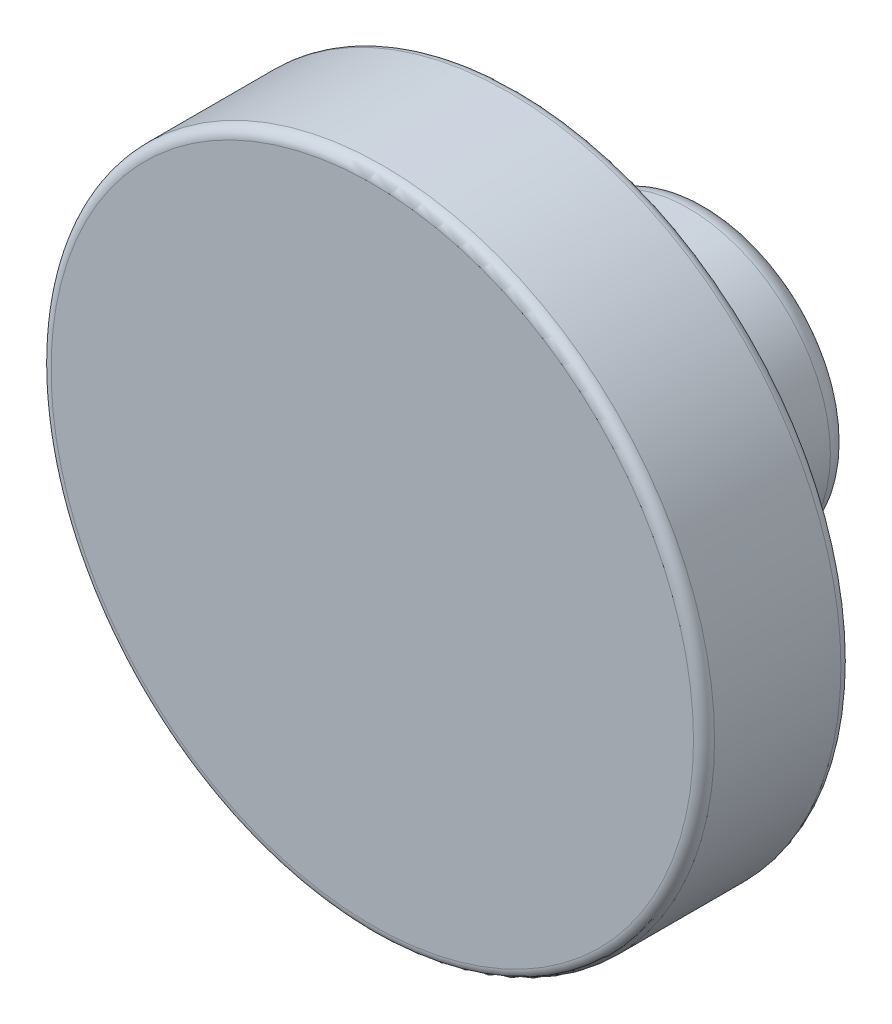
ISO-10303-21;
HEADER;
FILE_DESCRIPTION(('STEP AP214'),'2;1');
FILE_NAME('part.step','',(''),(''),'','','');
FILE_SCHEMA(('AUTOMOTIVE_DESIGN { 1 0 10303 214 1 1 1 1 }'));
ENDSEC;
DATA;
#1=APPLICATION_CONTEXT('core data for automotive mechanical design processes');
#2=APPLICATION_PROTOCOL_DEFINITION('international standard','automotive_design',2000,#1);
#3=PRODUCT_CONTEXT('',#1,'mechanical');
#4=PRODUCT('Part','Part','',(#3));
#5=PRODUCT_RELATED_PRODUCT_CATEGORY('part','',(#4));
#6=PRODUCT_DEFINITION_FORMATION('','',#4);
#7=PRODUCT_DEFINITION_CONTEXT('part definition',#1,'design');
#8=PRODUCT_DEFINITION('design','',#6,#7);
#9=PRODUCT_DEFINITION_SHAPE('','',#8);
#10=(LENGTH_UNIT() NAMED_UNIT(*) SI_UNIT(.MILLI.,.METRE.));
#11=(NAMED_UNIT(*) PLANE_ANGLE_UNIT() SI_UNIT($,.RADIAN.));
#12=(NAMED_UNIT(*) SI_UNIT($,.STERADIAN.) SOLID_ANGLE_UNIT());
#13=UNCERTAINTY_MEASURE_WITH_UNIT(LENGTH_MEASURE(1.E-05),#10,'distance_accuracy_value','');
#14=(GEOMETRIC_REPRESENTATION_CONTEXT(3) GLOBAL_UNCERTAINTY_ASSIGNED_CONTEXT((#13)) GLOBAL_UNIT_ASSIGNED_CONTEXT((#10,
#11,#12)) REPRESENTATION_CONTEXT('',''));
#15=CARTESIAN_POINT('',(0.,0.,0.));
#16=DIRECTION('',(0.,0.,1.));
#17=DIRECTION('',(1.,0.,0.));
#18=AXIS2_PLACEMENT_3D('',#15,#16,#17);
#19=CARTESIAN_POINT('',(0.,0.,15.));
#20=DIRECTION('',(0.,0.,1.));
#21=DIRECTION('',(1.,0.,0.));
#22=AXIS2_PLACEMENT_3D('',#19,#20,#21);
#23=PLANE('',#22);
#24=CARTESIAN_POINT('',(0.,0.,15.));
#25=DIRECTION('',(0.,0.,1.));
#26=DIRECTION('',(1.,0.,0.));
#27=AXIS2_PLACEMENT_3D('',#24,#25,#26);
#28=CIRCLE('',#27,2.5);
#29=CARTESIAN_POINT('',(2.5,0.,15.));
#30=VERTEX_POINT('',#29);
#31=EDGE_CURVE('E8',#30,#30,#28,.T.);
#32=ORIENTED_EDGE('',*,*,#31,.F.);
#33=EDGE_LOOP('',(#32));
#34=FACE_BOUND('',#33,.T.);
#35=ADVANCED_FACE('F12',(#34),#23,.F.);
#36=CARTESIAN_POINT('',(0.,0.,37.0000000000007));
#37=DIRECTION('',(0.,0.,1.));
#38=DIRECTION('',(1.,0.,0.));
#39=AXIS2_PLACEMENT_3D('',#36,#37,#38);
#40=CYLINDRICAL_SURFACE('',#39,2.5);
#41=CARTESIAN_POINT('',(0.,0.,0.));
#42=DIRECTION('',(0.,0.,1.));
#43=DIRECTION('',(1.,0.,0.));
#44=AXIS2_PLACEMENT_3D('',#41,#42,#43);
#45=CIRCLE('',#44,2.5);
#46=CARTESIAN_POINT('',(2.5,0.,0.));
#47=VERTEX_POINT('',#46);
#48=EDGE_CURVE('E18',#47,#47,#45,.T.);
#49=ORIENTED_EDGE('',*,*,#48,.F.);
#50=EDGE_LOOP('',(#49));
#51=FACE_BOUND('',#50,.T.);
#52=ORIENTED_EDGE('',*,*,#31,.T.);
#53=EDGE_LOOP('',(#52));
#54=FACE_BOUND('',#53,.T.);
#55=ADVANCED_FACE('F96',(#51,#54),#40,.F.);
#56=CARTESIAN_POINT('',(0.,2.5,0.));
#57=DIRECTION('',(0.,0.,1.));
#58=DIRECTION('',(1.,0.,0.));
#59=AXIS2_PLACEMENT_3D('',#56,#57,#58);
#60=PLANE('',#59);
#61=CARTESIAN_POINT('',(0.,0.,0.));
#62=DIRECTION('',(0.,0.,1.));
#63=DIRECTION('',(1.,0.,0.));
#64=AXIS2_PLACEMENT_3D('',#61,#62,#63);
#65=CIRCLE('',#64,11.5);
#66=CARTESIAN_POINT('',(11.5,0.,0.));
#67=VERTEX_POINT('',#66);
#68=EDGE_CURVE('E22',#67,#67,#65,.T.);
#69=ORIENTED_EDGE('',*,*,#68,.F.);
#70=EDGE_LOOP('',(#69));
#71=FACE_BOUND('',#70,.T.);
#72=ORIENTED_EDGE('',*,*,#48,.T.);
#73=EDGE_LOOP('',(#72));
#74=FACE_BOUND('',#73,.T.);
#75=ADVANCED_FACE('F91',(#71,#74),#60,.F.);
#76=CARTESIAN_POINT('',(0.,0.,2.));
#77=DIRECTION('',(0.,0.,1.));
#78=DIRECTION('',(1.,0.,0.));
#79=AXIS2_PLACEMENT_3D('',#76,#77,#78);
#80=TOROIDAL_SURFACE('',#79,11.5,2.);
#81=CARTESIAN_POINT('',(0.,0.,2.));
#82=DIRECTION('',(0.,0.,1.));
#83=DIRECTION('',(1.,0.,0.));
#84=AXIS2_PLACEMENT_3D('',#81,#82,#83);
#85=CIRCLE('',#84,13.5);
#86=CARTESIAN_POINT('',(13.5,0.,2.));
#87=VERTEX_POINT('',#86);
#88=EDGE_CURVE('E26',#87,#87,#85,.T.);
#89=ORIENTED_EDGE('',*,*,#88,.F.);
#90=EDGE_LOOP('',(#89));
#91=FACE_BOUND('',#90,.T.);
#92=ORIENTED_EDGE('',*,*,#68,.T.);
#93=EDGE_LOOP('',(#92));
#94=FACE_BOUND('',#93,.T.);
#95=ADVANCED_FACE('F85',(#91,#94),#80,.T.);
#96=CARTESIAN_POINT('',(0.,0.,37.0000000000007));
#97=DIRECTION('',(0.,0.,1.));
#98=DIRECTION('',(1.,0.,0.));
#99=AXIS2_PLACEMENT_3D('',#96,#97,#98);
#100=CYLINDRICAL_SURFACE('',#99,13.5);
#101=CARTESIAN_POINT('',(0.,0.,14.9999999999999));
#102=DIRECTION('',(0.,0.,1.));
#103=DIRECTION('',(1.,0.,0.));
#104=AXIS2_PLACEMENT_3D('',#101,#102,#103);
#105=CIRCLE('',#104,13.5);
#106=CARTESIAN_POINT('',(13.5,0.,14.9999999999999));
#107=VERTEX_POINT('',#106);
#108=EDGE_CURVE('E31',#107,#107,#105,.T.);
#109=ORIENTED_EDGE('',*,*,#108,.F.);
#110=EDGE_LOOP('',(#109));
#111=FACE_BOUND('',#110,.T.);
#112=ORIENTED_EDGE('',*,*,#88,.T.);
#113=EDGE_LOOP('',(#112));
#114=FACE_BOUND('',#113,.T.);
#115=ADVANCED_FACE('F79',(#111,#114),#100,.T.);
#116=CARTESIAN_POINT('',(0.,0.,14.9999999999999));
#117=DIRECTION('',(0.,0.,1.));
#118=DIRECTION('',(1.,0.,0.));
#119=AXIS2_PLACEMENT_3D('',#116,#117,#118);
#120=TOROIDAL_SURFACE('',#119,16.5,3.);
#121=CARTESIAN_POINT('',(0.,0.,18.));
#122=DIRECTION('',(0.,0.,1.));
#123=DIRECTION('',(1.,0.,0.));
#124=AXIS2_PLACEMENT_3D('',#121,#122,#123);
#125=CIRCLE('',#124,16.5);
#126=CARTESIAN_POINT('',(16.5,0.,18.));
#127=VERTEX_POINT('',#126);
#128=EDGE_CURVE('E34',#127,#127,#125,.T.);
#129=ORIENTED_EDGE('',*,*,#128,.F.);
#130=EDGE_LOOP('',(#129));
#131=FACE_BOUND('',#130,.T.);
#132=ORIENTED_EDGE('',*,*,#108,.T.);
#133=EDGE_LOOP('',(#132));
#134=FACE_BOUND('',#133,.T.);
#135=ADVANCED_FACE('F73',(#131,#134),#120,.F.);
#136=CARTESIAN_POINT('',(0.,30.5,18.));
#137=DIRECTION('',(0.,0.,1.));
#138=DIRECTION('',(1.,0.,0.));
#139=AXIS2_PLACEMENT_3D('',#136,#137,#138);
#140=PLANE('',#139);
#141=CARTESIAN_POINT('',(0.,0.,18.));
#142=DIRECTION('',(0.,0.,1.));
#143=DIRECTION('',(1.,0.,0.));
#144=AXIS2_PLACEMENT_3D('',#141,#142,#143);
#145=CIRCLE('',#144,30.5);
#146=CARTESIAN_POINT('',(30.5,0.,18.));
#147=VERTEX_POINT('',#146);
#148=EDGE_CURVE('E37',#147,#147,#145,.T.);
#149=ORIENTED_EDGE('',*,*,#148,.F.);
#150=EDGE_LOOP('',(#149));
#151=FACE_BOUND('',#150,.T.);
#152=ORIENTED_EDGE('',*,*,#128,.T.);
#153=EDGE_LOOP('',(#152));
#154=FACE_BOUND('',#153,.T.);
#155=ADVANCED_FACE('F67',(#151,#154),#140,.F.);
#156=CARTESIAN_POINT('',(0.,0.,19.));
#157=DIRECTION('',(0.,0.,1.));
#158=DIRECTION('',(1.,0.,0.));
#159=AXIS2_PLACEMENT_3D('',#156,#157,#158);
#160=TOROIDAL_SURFACE('',#159,30.5,1.00000000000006);
#161=CARTESIAN_POINT('',(0.,0.,19.));
#162=DIRECTION('',(0.,0.,1.));
#163=DIRECTION('',(1.,0.,0.));
#164=AXIS2_PLACEMENT_3D('',#161,#162,#163);
#165=CIRCLE('',#164,31.5);
#166=CARTESIAN_POINT('',(31.5,0.,19.));
#167=VERTEX_POINT('',#166);
#168=EDGE_CURVE('E40',#167,#167,#165,.T.);
#169=ORIENTED_EDGE('',*,*,#168,.F.);
#170=EDGE_LOOP('',(#169));
#171=FACE_BOUND('',#170,.T.);
#172=ORIENTED_EDGE('',*,*,#148,.T.);
#173=EDGE_LOOP('',(#172));
#174=FACE_BOUND('',#173,.T.);
#175=ADVANCED_FACE('F61',(#171,#174),#160,.T.);
#176=CARTESIAN_POINT('',(0.,0.,37.0000000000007));
#177=DIRECTION('',(0.,0.,1.));
#178=DIRECTION('',(1.,0.,0.));
#179=AXIS2_PLACEMENT_3D('',#176,#177,#178);
#180=CYLINDRICAL_SURFACE('',#179,31.5);
#181=CARTESIAN_POINT('',(0.,0.,31.));
#182=DIRECTION('',(0.,0.,1.));
#183=DIRECTION('',(1.,0.,0.));
#184=AXIS2_PLACEMENT_3D('',#181,#182,#183);
#185=CIRCLE('',#184,31.5);
#186=CARTESIAN_POINT('',(31.5,0.,31.));
#187=VERTEX_POINT('',#186);
#188=EDGE_CURVE('E43',#187,#187,#185,.T.);
#189=ORIENTED_EDGE('',*,*,#188,.F.);
#190=EDGE_LOOP('',(#189));
#191=FACE_BOUND('',#190,.T.);
#192=ORIENTED_EDGE('',*,*,#168,.T.);
#193=EDGE_LOOP('',(#192));
#194=FACE_BOUND('',#193,.T.);
#195=ADVANCED_FACE('F55',(#191,#194),#180,.T.);
#196=CARTESIAN_POINT('',(0.,0.,31.));
#197=DIRECTION('',(0.,0.,1.));
#198=DIRECTION('',(1.,0.,0.));
#199=AXIS2_PLACEMENT_3D('',#196,#197,#198);
#200=TOROIDAL_SURFACE('',#199,30.5,1.);
#201=CARTESIAN_POINT('',(0.,0.,32.));
#202=DIRECTION('',(0.,0.,1.));
#203=DIRECTION('',(1.,0.,0.));
#204=AXIS2_PLACEMENT_3D('',#201,#202,#203);
#205=CIRCLE('',#204,30.5);
#206=CARTESIAN_POINT('',(30.5,0.,32.));
#207=VERTEX_POINT('',#206);
#208=EDGE_CURVE('E46',#207,#207,#205,.T.);
#209=ORIENTED_EDGE('',*,*,#208,.F.);
#210=EDGE_LOOP('',(#209));
#211=FACE_BOUND('',#210,.T.);
#212=ORIENTED_EDGE('',*,*,#188,.T.);
#213=EDGE_LOOP('',(#212));
#214=FACE_BOUND('',#213,.T.);
#215=ADVANCED_FACE('F52',(#211,#214),#200,.T.);
#216=CARTESIAN_POINT('',(0.,0.,32.));
#217=DIRECTION('',(0.,0.,-1.));
#218=DIRECTION('',(-1.,0.,0.));
#219=AXIS2_PLACEMENT_3D('',#216,#217,#218);
#220=PLANE('',#219);
#221=ORIENTED_EDGE('',*,*,#208,.T.);
#222=EDGE_LOOP('',(#221));
#223=FACE_BOUND('',#222,.T.);
#224=ADVANCED_FACE('F50',(#223),#220,.F.);
#225=CLOSED_SHELL('',(#35,#55,#75,#95,#115,#135,#155,#175,#195,#215,#224));
#226=MANIFOLD_SOLID_BREP('B1',#225);
#227=ADVANCED_BREP_SHAPE_REPRESENTATION('',(#18,#226),#14);
#228=SHAPE_DEFINITION_REPRESENTATION(#9,#227);
ENDSEC;
END-ISO-10303-21;
